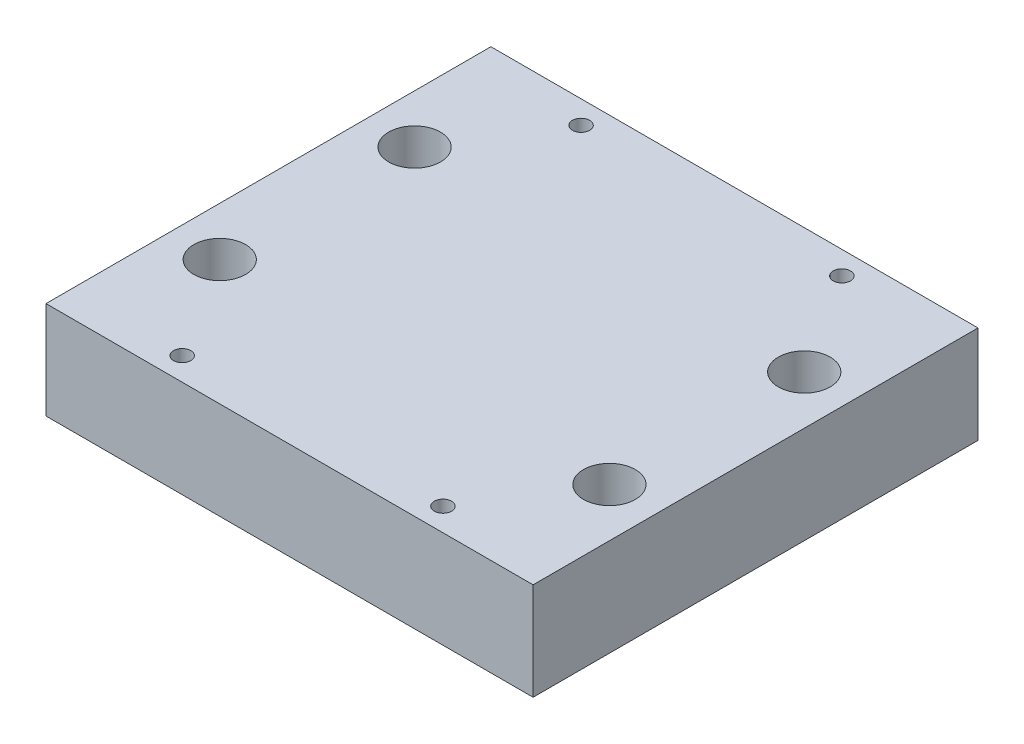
from build123d import *

# Parameters (mm, degrees)
SKETCH1_W                 = 63.5
SKETCH1_H                 = 58
BOSS_EXTRUDE1_DEPTH       = 12.7
F_4_40_TAPPED_HOLE1_D     = 2.2606
F_4_40_TAPPED_HOLE1_DEPTH = 6.35
F_4_40_TAPPED_HOLE1_TIP   = 0.679152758
H_0_266_DIAMETER_HOLE1_D  = 6.7564


with BuildPart() as part:
    # Sketch1 → Boss-Extrude1 (new body)
    with BuildSketch(Plane(origin=(0, 0, 0), x_dir=(1, 0, 0), z_dir=(0, 1, 0))):
        Rectangle(SKETCH1_W, SKETCH1_H)
    extrude(amount=BOSS_EXTRUDE1_DEPTH)

    # 4-40 Tapped Hole1
    with Locations(Plane(origin=(0, 12.7, 0), x_dir=(1, 0, 0), z_dir=(0, 1, 0))):
        with Locations((-17, 26), (17, 26), (17, -26), (-17, -26)):
            Hole(F_4_40_TAPPED_HOLE1_D / 2, depth=F_4_40_TAPPED_HOLE1_DEPTH)
            with Locations((0, 0, -(F_4_40_TAPPED_HOLE1_DEPTH + F_4_40_TAPPED_HOLE1_TIP / 2))):  # 118° drill point
                Cone(0, F_4_40_TAPPED_HOLE1_D / 2, F_4_40_TAPPED_HOLE1_TIP, mode=Mode.SUBTRACT)

    # H _0.266_ Diameter Hole1 (through all)
    with Locations(Plane(origin=(0, 12.7, 0), x_dir=(1, 0, 0), z_dir=(0, 1, 0))):
        with Locations((-25.4, 12.7), (25.4, 12.7), (-25.4, -12.7), (25.4, -12.7)):
            Hole(H_0_266_DIAMETER_HOLE1_D / 2)


solid = part.part
